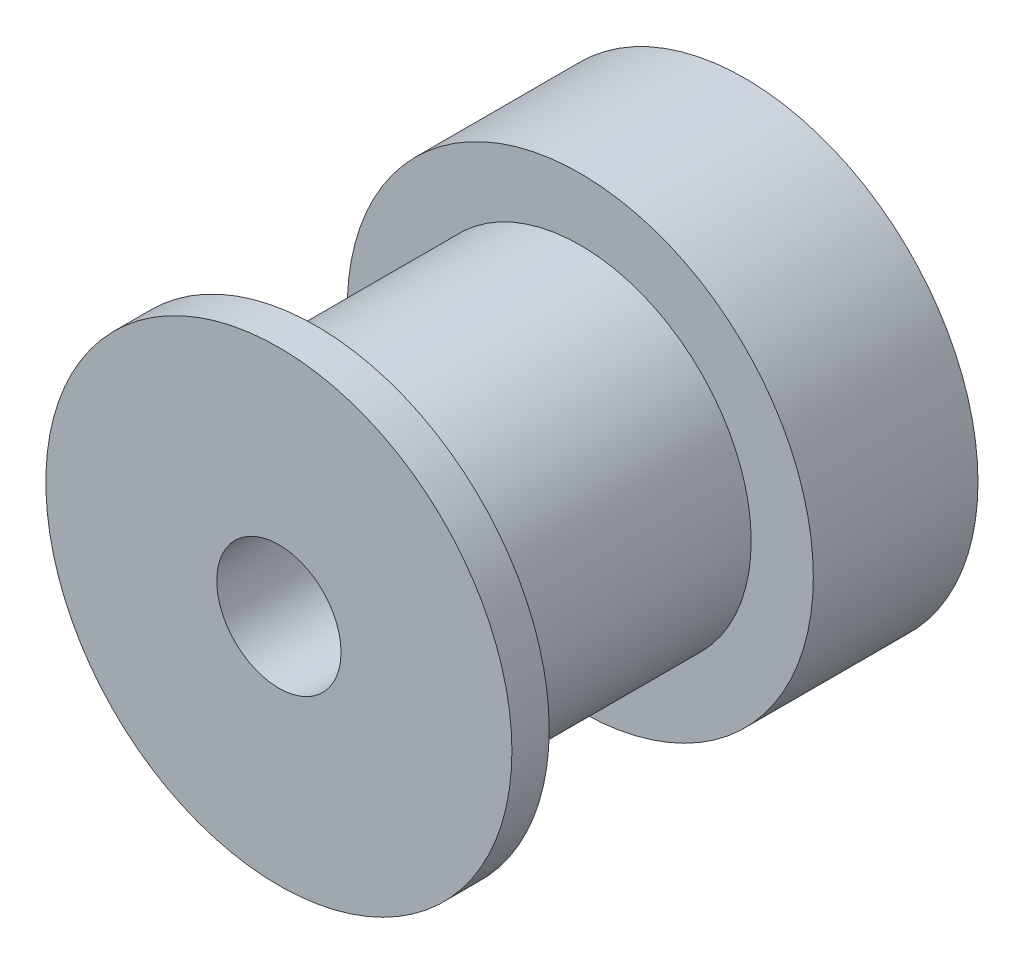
from build123d import *

# Parameters (mm, degrees)
SKETCH_1_R          = 7.5
EXTRUDE_1_DEPTH     = 15
CUT_EXTRUDE_START   = -9.7
SKETCH_2_R          = 7.5
SKETCH_2_R_2        = 5.5
CUT_EXTRUDE_1_DEPTH = 8.5
SKETCH_3_R          = 2
CUT_EXTRUDE_2_DEPTH = 19.371173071


with BuildPart() as part:
    # Sketch 1 → Extrude 1 (new body)
    with BuildSketch(Plane.XY):
        Circle(SKETCH_1_R)
    extrude(amount=EXTRUDE_1_DEPTH)

    # Sketch 2 → Cut-Extrude 1 (cut)
    with BuildSketch(Plane.XY.offset(15).offset(CUT_EXTRUDE_START)):
        Circle(SKETCH_2_R)
        Circle(SKETCH_2_R_2, mode=Mode.SUBTRACT)
    extrude(amount=CUT_EXTRUDE_1_DEPTH, mode=Mode.SUBTRACT)

    # Sketch 3 → Cut-Extrude 2 (cut, through all)
    with BuildSketch(Plane.XY.offset(15)):
        Circle(SKETCH_3_R)
    extrude(amount=-CUT_EXTRUDE_2_DEPTH, mode=Mode.SUBTRACT)


solid = part.part
